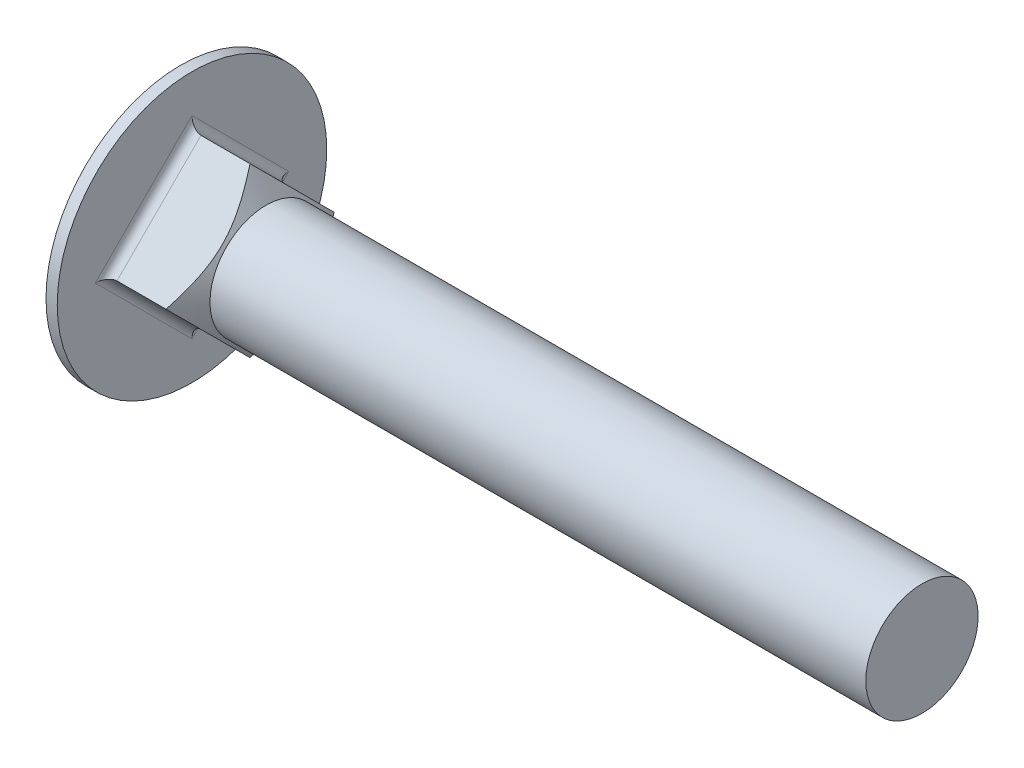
ISO-10303-21;
HEADER;
FILE_DESCRIPTION(('STEP AP214'),'2;1');
FILE_NAME('part.step','',(''),(''),'','','');
FILE_SCHEMA(('AUTOMOTIVE_DESIGN { 1 0 10303 214 1 1 1 1 }'));
ENDSEC;
DATA;
#1=APPLICATION_CONTEXT('core data for automotive mechanical design processes');
#2=APPLICATION_PROTOCOL_DEFINITION('international standard','automotive_design',2000,#1);
#3=PRODUCT_CONTEXT('',#1,'mechanical');
#4=PRODUCT('Part','Part','',(#3));
#5=PRODUCT_RELATED_PRODUCT_CATEGORY('part','',(#4));
#6=PRODUCT_DEFINITION_FORMATION('','',#4);
#7=PRODUCT_DEFINITION_CONTEXT('part definition',#1,'design');
#8=PRODUCT_DEFINITION('design','',#6,#7);
#9=PRODUCT_DEFINITION_SHAPE('','',#8);
#10=(LENGTH_UNIT() NAMED_UNIT(*) SI_UNIT(.MILLI.,.METRE.));
#11=(NAMED_UNIT(*) PLANE_ANGLE_UNIT() SI_UNIT($,.RADIAN.));
#12=(NAMED_UNIT(*) SI_UNIT($,.STERADIAN.) SOLID_ANGLE_UNIT());
#13=UNCERTAINTY_MEASURE_WITH_UNIT(LENGTH_MEASURE(1.E-05),#10,'distance_accuracy_value','');
#14=(GEOMETRIC_REPRESENTATION_CONTEXT(3) GLOBAL_UNCERTAINTY_ASSIGNED_CONTEXT((#13)) GLOBAL_UNIT_ASSIGNED_CONTEXT((#10,
#11,#12)) REPRESENTATION_CONTEXT('',''));
#15=CARTESIAN_POINT('',(0.,0.,0.));
#16=DIRECTION('',(0.,0.,1.));
#17=DIRECTION('',(1.,0.,0.));
#18=AXIS2_PLACEMENT_3D('',#15,#16,#17);
#19=CARTESIAN_POINT('',(11.6,7.48118974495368,0.));
#20=DIRECTION('',(0.,-0.707106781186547,-0.707106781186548));
#21=DIRECTION('',(0.,0.707106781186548,-0.707106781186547));
#22=AXIS2_PLACEMENT_3D('',#19,#20,#21);
#23=PLANE('',#22);
#24=DIRECTION('',(-1.,0.,0.));
#25=VECTOR('',#24,1.);
#26=CARTESIAN_POINT('',(11.6,7.48118974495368,0.));
#27=LINE('',#26,#25);
#28=CARTESIAN_POINT('',(10.1674844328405,7.48118974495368,0.));
#29=VERTEX_POINT('',#28);
#30=CARTESIAN_POINT('',(5.8,7.48118974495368,0.));
#31=VERTEX_POINT('',#30);
#32=EDGE_CURVE('E97',#29,#31,#27,.T.);
#33=ORIENTED_EDGE('',*,*,#32,.T.);
#34=DIRECTION('',(0.,-0.707106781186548,0.707106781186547));
#35=VECTOR('',#34,1.);
#36=CARTESIAN_POINT('',(5.8,0.,7.48118974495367));
#37=LINE('',#36,#35);
#38=CARTESIAN_POINT('',(5.8,0.,7.48118974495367));
#39=VERTEX_POINT('',#38);
#40=EDGE_CURVE('E11',#31,#39,#37,.T.);
#41=ORIENTED_EDGE('',*,*,#40,.T.);
#42=DIRECTION('',(-1.,0.,0.));
#43=VECTOR('',#42,1.);
#44=CARTESIAN_POINT('',(11.6,0.,7.48118974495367));
#45=LINE('',#44,#43);
#46=CARTESIAN_POINT('',(10.1674844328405,0.,7.48118974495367));
#47=VERTEX_POINT('',#46);
#48=EDGE_CURVE('E100',#47,#39,#45,.T.);
#49=ORIENTED_EDGE('',*,*,#48,.F.);
#50=CARTESIAN_POINT('',(10.1673689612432,7.48138974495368,-0.000200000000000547));
#51=CARTESIAN_POINT('',(10.240783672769,7.35418891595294,0.12700082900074));
#52=CARTESIAN_POINT('',(10.3126426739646,7.22652847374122,0.254661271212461));
#53=CARTESIAN_POINT('',(10.4525130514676,6.97010913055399,0.511080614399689));
#54=CARTESIAN_POINT('',(10.5205230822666,6.84134986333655,0.639839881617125));
#55=CARTESIAN_POINT('',(10.6523125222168,6.58184380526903,0.89934593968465));
#56=CARTESIAN_POINT('',(10.7160632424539,6.45108965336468,1.03010009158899));
#57=CARTESIAN_POINT('',(10.8378670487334,6.18828600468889,1.29290374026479));
#58=CARTESIAN_POINT('',(10.8959206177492,6.05623661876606,1.42495312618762));
#59=CARTESIAN_POINT('',(11.0579955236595,5.66240203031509,1.81878771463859));
#60=CARTESIAN_POINT('',(11.1522638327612,5.39848601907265,2.08270372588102));
#61=CARTESIAN_POINT('',(11.2659727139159,4.9989997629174,2.48218998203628));
#62=CARTESIAN_POINT('',(11.2992396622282,4.8653775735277,2.61581217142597));
#63=CARTESIAN_POINT('',(11.3553270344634,4.59703103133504,2.88415871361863));
#64=CARTESIAN_POINT('',(11.3781485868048,4.46230679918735,3.01888294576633));
#65=CARTESIAN_POINT('',(11.4095386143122,4.21418271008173,3.26700703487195));
#66=CARTESIAN_POINT('',(11.419825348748,4.10089096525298,3.3802987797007));
#67=CARTESIAN_POINT('',(11.432020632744,3.87408144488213,3.60710830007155));
#68=CARTESIAN_POINT('',(11.4339294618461,3.76056367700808,3.72062606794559));
#69=CARTESIAN_POINT('',(11.429298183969,3.53356534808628,3.9476243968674));
#70=CARTESIAN_POINT('',(11.4227543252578,3.42008482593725,4.06110491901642));
#71=CARTESIAN_POINT('',(11.4014440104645,3.19351279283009,4.28767695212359));
#72=CARTESIAN_POINT('',(11.3866774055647,3.08042128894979,4.40076845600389));
#73=CARTESIAN_POINT('',(11.3493818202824,2.85469228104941,4.62649746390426));
#74=CARTESIAN_POINT('',(11.3268398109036,2.74205586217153,4.73913388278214));
#75=CARTESIAN_POINT('',(11.2746714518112,2.51760014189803,4.96358960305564));
#76=CARTESIAN_POINT('',(11.2450439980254,2.40578097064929,5.07540877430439));
#77=CARTESIAN_POINT('',(11.1466904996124,2.07172551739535,5.40946422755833));
#78=CARTESIAN_POINT('',(11.0684895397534,1.85087007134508,5.6303196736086));
#79=CARTESIAN_POINT('',(10.9249180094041,1.49278451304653,5.98840523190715));
#80=CARTESIAN_POINT('',(10.8652320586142,1.35436598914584,6.12682375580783));
#81=CARTESIAN_POINT('',(10.7394865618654,1.07902541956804,6.40216432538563));
#82=CARTESIAN_POINT('',(10.6734289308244,0.942102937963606,6.53908680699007));
#83=CARTESIAN_POINT('',(10.536441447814,0.670289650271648,6.81090009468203));
#84=CARTESIAN_POINT('',(10.4655384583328,0.535392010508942,6.94579773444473));
#85=CARTESIAN_POINT('',(10.3194467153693,0.26676122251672,7.21442852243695));
#86=CARTESIAN_POINT('',(10.244258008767,0.133028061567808,7.34816168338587));
#87=CARTESIAN_POINT('',(10.1673689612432,-0.000199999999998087,7.48138974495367));
#88=B_SPLINE_CURVE_WITH_KNOTS('',3,(#50,#51,#52,#53,#54,#55,#56,#57,#58,#59,#60,#61,#62,#63,#64,
#65,#66,#67,#68,#69,#70,#71,#72,#73,#74,#75,#76,#77,#78,#79,#80,#81,#82,#83,#84,#85,#86,#87),
.UNSPECIFIED.,.F.,.F.,(4,2,2,2,2,2,2,2,2,2,2,2,2,2,2,2,2,2,4),(0.,0.582891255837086,
1.16598503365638,1.7526761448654,2.33931747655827,3.49252008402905,4.0679164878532,
4.64325071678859,5.1246910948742,5.60611540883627,6.08775347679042,6.56940026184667,
7.05185807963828,7.53439112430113,8.49936674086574,9.11323203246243,9.72691340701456,
10.3374322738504,10.9479444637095),.UNSPECIFIED.);
#89=EDGE_CURVE('E89',#29,#47,#88,.T.);
#90=ORIENTED_EDGE('',*,*,#89,.F.);
#91=EDGE_LOOP('',(#33,#41,#49,#90));
#92=FACE_BOUND('',#91,.T.);
#93=ADVANCED_FACE('F35',(#92),#23,.F.);
#94=CARTESIAN_POINT('',(11.6,0.,7.48118974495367));
#95=DIRECTION('',(0.,0.707106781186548,-0.707106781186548));
#96=DIRECTION('',(0.,0.707106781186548,0.707106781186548));
#97=AXIS2_PLACEMENT_3D('',#94,#95,#96);
#98=PLANE('',#97);
#99=ORIENTED_EDGE('',*,*,#48,.T.);
#100=DIRECTION('',(0.,-0.707106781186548,-0.707106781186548));
#101=VECTOR('',#100,1.);
#102=CARTESIAN_POINT('',(5.8,-7.48118974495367,0.));
#103=LINE('',#102,#101);
#104=CARTESIAN_POINT('',(5.8,-7.48118974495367,0.));
#105=VERTEX_POINT('',#104);
#106=EDGE_CURVE('E44',#39,#105,#103,.T.);
#107=ORIENTED_EDGE('',*,*,#106,.T.);
#108=DIRECTION('',(-1.,0.,0.));
#109=VECTOR('',#108,1.);
#110=CARTESIAN_POINT('',(11.6,-7.48118974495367,0.));
#111=LINE('',#110,#109);
#112=CARTESIAN_POINT('',(10.1674844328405,-7.48118974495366,0.));
#113=VERTEX_POINT('',#112);
#114=EDGE_CURVE('E101',#113,#105,#111,.T.);
#115=ORIENTED_EDGE('',*,*,#114,.F.);
#116=CARTESIAN_POINT('',(10.1673689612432,0.000200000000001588,7.48138974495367));
#117=CARTESIAN_POINT('',(10.240783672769,-0.12700082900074,7.35418891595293));
#118=CARTESIAN_POINT('',(10.3126426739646,-0.25466127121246,7.22652847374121));
#119=CARTESIAN_POINT('',(10.4525130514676,-0.511080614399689,6.97010913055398));
#120=CARTESIAN_POINT('',(10.5205230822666,-0.639839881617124,6.84134986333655));
#121=CARTESIAN_POINT('',(10.6523125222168,-0.89934593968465,6.58184380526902));
#122=CARTESIAN_POINT('',(10.7160632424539,-1.03010009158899,6.45108965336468));
#123=CARTESIAN_POINT('',(10.8378670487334,-1.29290374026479,6.18828600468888));
#124=CARTESIAN_POINT('',(10.8959206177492,-1.42495312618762,6.05623661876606));
#125=CARTESIAN_POINT('',(11.0579955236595,-1.81878771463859,5.66240203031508));
#126=CARTESIAN_POINT('',(11.1522638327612,-2.08270372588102,5.39848601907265));
#127=CARTESIAN_POINT('',(11.2659727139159,-2.48218998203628,4.99899976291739));
#128=CARTESIAN_POINT('',(11.2992396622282,-2.61581217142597,4.8653775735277));
#129=CARTESIAN_POINT('',(11.3553270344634,-2.88415871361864,4.59703103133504));
#130=CARTESIAN_POINT('',(11.3781485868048,-3.01888294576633,4.46230679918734));
#131=CARTESIAN_POINT('',(11.4095386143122,-3.26700703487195,4.21418271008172));
#132=CARTESIAN_POINT('',(11.419825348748,-3.3802987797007,4.10089096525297));
#133=CARTESIAN_POINT('',(11.432020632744,-3.60710830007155,3.87408144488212));
#134=CARTESIAN_POINT('',(11.4339294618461,-3.7206260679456,3.76056367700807));
#135=CARTESIAN_POINT('',(11.4292981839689,-3.9476243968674,3.53356534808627));
#136=CARTESIAN_POINT('',(11.4227543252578,-4.06110491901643,3.42008482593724));
#137=CARTESIAN_POINT('',(11.4014440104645,-4.28767695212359,3.19351279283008));
#138=CARTESIAN_POINT('',(11.3866774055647,-4.40076845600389,3.08042128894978));
#139=CARTESIAN_POINT('',(11.3493818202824,-4.62649746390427,2.8546922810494));
#140=CARTESIAN_POINT('',(11.3268398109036,-4.73913388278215,2.74205586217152));
#141=CARTESIAN_POINT('',(11.2746714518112,-4.96358960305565,2.51760014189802));
#142=CARTESIAN_POINT('',(11.2450439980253,-5.07540877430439,2.40578097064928));
#143=CARTESIAN_POINT('',(11.1466904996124,-5.40946422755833,2.07172551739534));
#144=CARTESIAN_POINT('',(11.0684895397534,-5.63031967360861,1.85087007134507));
#145=CARTESIAN_POINT('',(10.9249180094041,-5.98840523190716,1.49278451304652));
#146=CARTESIAN_POINT('',(10.8652320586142,-6.12682375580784,1.35436598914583));
#147=CARTESIAN_POINT('',(10.7394865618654,-6.40216432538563,1.07902541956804));
#148=CARTESIAN_POINT('',(10.6734289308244,-6.53908680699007,0.942102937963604));
#149=CARTESIAN_POINT('',(10.536441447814,-6.81090009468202,0.67028965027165));
#150=CARTESIAN_POINT('',(10.4655384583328,-6.94579773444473,0.535392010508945));
#151=CARTESIAN_POINT('',(10.3194467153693,-7.21442852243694,0.266761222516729));
#152=CARTESIAN_POINT('',(10.244258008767,-7.34816168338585,0.133028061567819));
#153=CARTESIAN_POINT('',(10.1673689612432,-7.48138974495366,-0.000199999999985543));
#154=B_SPLINE_CURVE_WITH_KNOTS('',3,(#116,#117,#118,#119,#120,#121,#122,#123,#124,#125,#126,
#127,#128,#129,#130,#131,#132,#133,#134,#135,#136,#137,#138,#139,#140,#141,#142,#143,#144,#145,
#146,#147,#148,#149,#150,#151,#152,#153),.UNSPECIFIED.,.F.,.F.,(4,2,2,2,2,2,2,2,2,2,2,2,2,2,2,2,
2,2,4),(0.,0.582891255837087,1.16598503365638,1.7526761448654,2.33931747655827,3.49252008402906,
4.06791648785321,4.6432507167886,5.1246910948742,5.60611540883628,6.08775347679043,
6.56940026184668,7.05185807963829,7.53439112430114,8.49936674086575,9.11323203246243,
9.72691340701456,10.3374322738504,10.9479444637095),.UNSPECIFIED.);
#155=EDGE_CURVE('E92',#47,#113,#154,.T.);
#156=ORIENTED_EDGE('',*,*,#155,.F.);
#157=EDGE_LOOP('',(#99,#107,#115,#156));
#158=FACE_BOUND('',#157,.T.);
#159=ADVANCED_FACE('F99',(#158),#98,.F.);
#160=CARTESIAN_POINT('',(11.6,-7.48118974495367,0.));
#161=DIRECTION('',(0.,0.707106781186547,0.707106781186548));
#162=DIRECTION('',(0.,-0.707106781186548,0.707106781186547));
#163=AXIS2_PLACEMENT_3D('',#160,#161,#162);
#164=PLANE('',#163);
#165=ORIENTED_EDGE('',*,*,#114,.T.);
#166=DIRECTION('',(0.,0.707106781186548,-0.707106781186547));
#167=VECTOR('',#166,1.);
#168=CARTESIAN_POINT('',(5.8,0.,-7.48118974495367));
#169=LINE('',#168,#167);
#170=CARTESIAN_POINT('',(5.8,0.,-7.48118974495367));
#171=VERTEX_POINT('',#170);
#172=EDGE_CURVE('E127',#105,#171,#169,.T.);
#173=ORIENTED_EDGE('',*,*,#172,.T.);
#174=DIRECTION('',(-1.,0.,0.));
#175=VECTOR('',#174,1.);
#176=CARTESIAN_POINT('',(11.6,0.,-7.48118974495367));
#177=LINE('',#176,#175);
#178=CARTESIAN_POINT('',(10.1674844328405,0.,-7.48118974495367));
#179=VERTEX_POINT('',#178);
#180=EDGE_CURVE('E109',#179,#171,#177,.T.);
#181=ORIENTED_EDGE('',*,*,#180,.F.);
#182=CARTESIAN_POINT('',(10.1673689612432,-7.48138974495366,0.000199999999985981));
#183=CARTESIAN_POINT('',(10.240783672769,-7.35418891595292,-0.127000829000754));
#184=CARTESIAN_POINT('',(10.3126426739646,-7.2265284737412,-0.254661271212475));
#185=CARTESIAN_POINT('',(10.4525130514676,-6.97010913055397,-0.511080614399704));
#186=CARTESIAN_POINT('',(10.5205230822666,-6.84134986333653,-0.63983988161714));
#187=CARTESIAN_POINT('',(10.6523125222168,-6.58184380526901,-0.899345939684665));
#188=CARTESIAN_POINT('',(10.7160632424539,-6.45108965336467,-1.03010009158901));
#189=CARTESIAN_POINT('',(10.8378670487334,-6.18828600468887,-1.2929037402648));
#190=CARTESIAN_POINT('',(10.8959206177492,-6.05623661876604,-1.42495312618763));
#191=CARTESIAN_POINT('',(11.0579955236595,-5.66240203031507,-1.8187877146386));
#192=CARTESIAN_POINT('',(11.1522638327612,-5.39848601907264,-2.08270372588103));
#193=CARTESIAN_POINT('',(11.2659727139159,-4.99899976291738,-2.48218998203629));
#194=CARTESIAN_POINT('',(11.2992396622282,-4.86537757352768,-2.61581217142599));
#195=CARTESIAN_POINT('',(11.3553270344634,-4.59703103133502,-2.88415871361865));
#196=CARTESIAN_POINT('',(11.3781485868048,-4.46230679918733,-3.01888294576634));
#197=CARTESIAN_POINT('',(11.4095386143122,-4.21418271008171,-3.26700703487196));
#198=CARTESIAN_POINT('',(11.419825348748,-4.10089096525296,-3.38029877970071));
#199=CARTESIAN_POINT('',(11.432020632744,-3.87408144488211,-3.60710830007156));
#200=CARTESIAN_POINT('',(11.433929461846,-3.76056367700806,-3.72062606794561));
#201=CARTESIAN_POINT('',(11.4292981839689,-3.53356534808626,-3.94762439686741));
#202=CARTESIAN_POINT('',(11.4227543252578,-3.42008482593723,-4.06110491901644));
#203=CARTESIAN_POINT('',(11.4014440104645,-3.19351279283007,-4.2876769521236));
#204=CARTESIAN_POINT('',(11.3866774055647,-3.08042128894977,-4.4007684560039));
#205=CARTESIAN_POINT('',(11.3493818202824,-2.85469228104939,-4.62649746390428));
#206=CARTESIAN_POINT('',(11.3268398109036,-2.74205586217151,-4.73913388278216));
#207=CARTESIAN_POINT('',(11.2746714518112,-2.51760014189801,-4.96358960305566));
#208=CARTESIAN_POINT('',(11.2450439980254,-2.40578097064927,-5.0754087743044));
#209=CARTESIAN_POINT('',(11.1466904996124,-2.07172551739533,-5.40946422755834));
#210=CARTESIAN_POINT('',(11.0684895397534,-1.85087007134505,-5.63031967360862));
#211=CARTESIAN_POINT('',(10.9249180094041,-1.49278451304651,-5.98840523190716));
#212=CARTESIAN_POINT('',(10.8652320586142,-1.35436598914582,-6.12682375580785));
#213=CARTESIAN_POINT('',(10.7394865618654,-1.07902541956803,-6.40216432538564));
#214=CARTESIAN_POINT('',(10.6734289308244,-0.94210293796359,-6.53908680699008));
#215=CARTESIAN_POINT('',(10.536441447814,-0.670289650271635,-6.81090009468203));
#216=CARTESIAN_POINT('',(10.4655384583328,-0.53539201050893,-6.94579773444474));
#217=CARTESIAN_POINT('',(10.3194467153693,-0.266761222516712,-7.21442852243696));
#218=CARTESIAN_POINT('',(10.244258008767,-0.133028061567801,-7.34816168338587));
#219=CARTESIAN_POINT('',(10.1673689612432,0.000200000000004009,-7.48138974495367));
#220=B_SPLINE_CURVE_WITH_KNOTS('',3,(#182,#183,#184,#185,#186,#187,#188,#189,#190,#191,#192,
#193,#194,#195,#196,#197,#198,#199,#200,#201,#202,#203,#204,#205,#206,#207,#208,#209,#210,#211,
#212,#213,#214,#215,#216,#217,#218,#219),.UNSPECIFIED.,.F.,.F.,(4,2,2,2,2,2,2,2,2,2,2,2,2,2,2,2,
2,2,4),(0.,0.582891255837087,1.16598503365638,1.7526761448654,2.33931747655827,3.49252008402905,
4.0679164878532,4.64325071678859,5.1246910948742,5.60611540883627,6.08775347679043,
6.56940026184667,7.05185807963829,7.53439112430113,8.49936674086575,9.11323203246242,
9.72691340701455,10.3374322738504,10.9479444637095),.UNSPECIFIED.);
#221=EDGE_CURVE('E102',#113,#179,#220,.T.);
#222=ORIENTED_EDGE('',*,*,#221,.F.);
#223=EDGE_LOOP('',(#165,#173,#181,#222));
#224=FACE_BOUND('',#223,.T.);
#225=ADVANCED_FACE('F184',(#224),#164,.F.);
#226=CARTESIAN_POINT('',(11.6,0.,-7.48118974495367));
#227=DIRECTION('',(0.,-0.707106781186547,0.707106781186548));
#228=DIRECTION('',(0.,-0.707106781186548,-0.707106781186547));
#229=AXIS2_PLACEMENT_3D('',#226,#227,#228);
#230=PLANE('',#229);
#231=ORIENTED_EDGE('',*,*,#180,.T.);
#232=DIRECTION('',(0.,0.707106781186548,0.707106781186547));
#233=VECTOR('',#232,1.);
#234=CARTESIAN_POINT('',(5.8,7.48118974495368,0.));
#235=LINE('',#234,#233);
#236=EDGE_CURVE('E115',#171,#31,#235,.T.);
#237=ORIENTED_EDGE('',*,*,#236,.T.);
#238=ORIENTED_EDGE('',*,*,#32,.F.);
#239=CARTESIAN_POINT('',(10.1673689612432,-0.000199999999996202,-7.48138974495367));
#240=CARTESIAN_POINT('',(10.240783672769,0.127000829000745,-7.35418891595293));
#241=CARTESIAN_POINT('',(10.3126426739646,0.254661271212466,-7.22652847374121));
#242=CARTESIAN_POINT('',(10.4525130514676,0.511080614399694,-6.97010913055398));
#243=CARTESIAN_POINT('',(10.5205230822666,0.639839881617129,-6.84134986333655));
#244=CARTESIAN_POINT('',(10.6523125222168,0.899345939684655,-6.58184380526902));
#245=CARTESIAN_POINT('',(10.7160632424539,1.030100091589,-6.45108965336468));
#246=CARTESIAN_POINT('',(10.8378670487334,1.29290374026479,-6.18828600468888));
#247=CARTESIAN_POINT('',(10.8959206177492,1.42495312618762,-6.05623661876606));
#248=CARTESIAN_POINT('',(11.0579955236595,1.81878771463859,-5.66240203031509));
#249=CARTESIAN_POINT('',(11.1522638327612,2.08270372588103,-5.39848601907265));
#250=CARTESIAN_POINT('',(11.2659727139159,2.48218998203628,-4.99899976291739));
#251=CARTESIAN_POINT('',(11.2992396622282,2.61581217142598,-4.8653775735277));
#252=CARTESIAN_POINT('',(11.3553270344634,2.88415871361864,-4.59703103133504));
#253=CARTESIAN_POINT('',(11.3781485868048,3.01888294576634,-4.46230679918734));
#254=CARTESIAN_POINT('',(11.4095386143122,3.26700703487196,-4.21418271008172));
#255=CARTESIAN_POINT('',(11.419825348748,3.3802987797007,-4.10089096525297));
#256=CARTESIAN_POINT('',(11.432020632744,3.60710830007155,-3.87408144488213));
#257=CARTESIAN_POINT('',(11.4339294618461,3.7206260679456,-3.76056367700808));
#258=CARTESIAN_POINT('',(11.4292981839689,3.9476243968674,-3.53356534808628));
#259=CARTESIAN_POINT('',(11.4227543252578,4.06110491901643,-3.42008482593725));
#260=CARTESIAN_POINT('',(11.4014440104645,4.28767695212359,-3.19351279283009));
#261=CARTESIAN_POINT('',(11.3866774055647,4.40076845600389,-3.08042128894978));
#262=CARTESIAN_POINT('',(11.3493818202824,4.62649746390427,-2.85469228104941));
#263=CARTESIAN_POINT('',(11.3268398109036,4.73913388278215,-2.74205586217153));
#264=CARTESIAN_POINT('',(11.2746714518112,4.96358960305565,-2.51760014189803));
#265=CARTESIAN_POINT('',(11.2450439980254,5.07540877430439,-2.40578097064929));
#266=CARTESIAN_POINT('',(11.1466904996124,5.40946422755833,-2.07172551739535));
#267=CARTESIAN_POINT('',(11.0684895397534,5.6303196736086,-1.85087007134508));
#268=CARTESIAN_POINT('',(10.9249180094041,5.98840523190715,-1.49278451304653));
#269=CARTESIAN_POINT('',(10.8652320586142,6.12682375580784,-1.35436598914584));
#270=CARTESIAN_POINT('',(10.7394865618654,6.40216432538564,-1.07902541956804));
#271=CARTESIAN_POINT('',(10.6734289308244,6.53908680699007,-0.942102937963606));
#272=CARTESIAN_POINT('',(10.5364414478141,6.81090009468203,-0.670289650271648));
#273=CARTESIAN_POINT('',(10.4655384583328,6.94579773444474,-0.535392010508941));
#274=CARTESIAN_POINT('',(10.3194467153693,7.21442852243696,-0.26676122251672));
#275=CARTESIAN_POINT('',(10.244258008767,7.34816168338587,-0.133028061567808));
#276=CARTESIAN_POINT('',(10.1673689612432,7.48138974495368,0.000199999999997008));
#277=B_SPLINE_CURVE_WITH_KNOTS('',3,(#239,#240,#241,#242,#243,#244,#245,#246,#247,#248,#249,
#250,#251,#252,#253,#254,#255,#256,#257,#258,#259,#260,#261,#262,#263,#264,#265,#266,#267,#268,
#269,#270,#271,#272,#273,#274,#275,#276),.UNSPECIFIED.,.F.,.F.,(4,2,2,2,2,2,2,2,2,2,2,2,2,2,2,2,
2,2,4),(0.,0.582891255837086,1.16598503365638,1.7526761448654,2.33931747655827,3.49252008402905,
4.0679164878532,4.64325071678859,5.1246910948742,5.60611540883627,6.08775347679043,
6.56940026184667,7.05185807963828,7.53439112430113,8.49936674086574,9.11323203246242,
9.72691340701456,10.3374322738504,10.9479444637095),.UNSPECIFIED.);
#278=EDGE_CURVE('E95',#179,#29,#277,.T.);
#279=ORIENTED_EDGE('',*,*,#278,.F.);
#280=EDGE_LOOP('',(#231,#237,#238,#279));
#281=FACE_BOUND('',#280,.T.);
#282=ADVANCED_FACE('F159',(#281),#230,.F.);
#283=CARTESIAN_POINT('',(5.,12.,0.));
#284=DIRECTION('',(-1.,0.,0.));
#285=DIRECTION('',(0.,0.,1.));
#286=AXIS2_PLACEMENT_3D('',#283,#284,#285);
#287=PLANE('',#286);
#288=DIRECTION('',(0.,-0.707106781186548,0.707106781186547));
#289=VECTOR('',#288,1.);
#290=CARTESIAN_POINT('',(5.,8.04687516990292,0.565685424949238));
#291=LINE('',#290,#289);
#292=CARTESIAN_POINT('',(5.,0.,8.61256059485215));
#293=VERTEX_POINT('',#292);
#294=CARTESIAN_POINT('',(5.,8.61256059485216,0.));
#295=VERTEX_POINT('',#294);
#296=EDGE_CURVE('E118',#293,#295,#291,.F.);
#297=ORIENTED_EDGE('',*,*,#296,.T.);
#298=DIRECTION('',(0.,0.707106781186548,0.707106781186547));
#299=VECTOR('',#298,1.);
#300=CARTESIAN_POINT('',(5.,0.565685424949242,-8.04687516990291));
#301=LINE('',#300,#299);
#302=CARTESIAN_POINT('',(5.,0.,-8.61256059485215));
#303=VERTEX_POINT('',#302);
#304=EDGE_CURVE('E124',#295,#303,#301,.F.);
#305=ORIENTED_EDGE('',*,*,#304,.T.);
#306=DIRECTION('',(0.,0.707106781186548,-0.707106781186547));
#307=VECTOR('',#306,1.);
#308=CARTESIAN_POINT('',(5.,-8.04687516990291,-0.565685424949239));
#309=LINE('',#308,#307);
#310=CARTESIAN_POINT('',(5.,-8.61256059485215,0.));
#311=VERTEX_POINT('',#310);
#312=EDGE_CURVE('E122',#303,#311,#309,.F.);
#313=ORIENTED_EDGE('',*,*,#312,.T.);
#314=DIRECTION('',(0.,-0.707106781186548,-0.707106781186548));
#315=VECTOR('',#314,1.);
#316=CARTESIAN_POINT('',(5.,-0.565685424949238,8.04687516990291));
#317=LINE('',#316,#315);
#318=EDGE_CURVE('E120',#311,#293,#317,.F.);
#319=ORIENTED_EDGE('',*,*,#318,.T.);
#320=EDGE_LOOP('',(#297,#305,#313,#319));
#321=FACE_BOUND('',#320,.T.);
#322=CARTESIAN_POINT('',(5.,0.,0.));
#323=DIRECTION('',(-1.,0.,0.));
#324=DIRECTION('',(0.,0.,1.));
#325=AXIS2_PLACEMENT_3D('',#322,#323,#324);
#326=CIRCLE('',#325,12.);
#327=CARTESIAN_POINT('',(5.,0.,12.));
#328=VERTEX_POINT('',#327);
#329=EDGE_CURVE('E107',#328,#328,#326,.T.);
#330=ORIENTED_EDGE('',*,*,#329,.F.);
#331=EDGE_LOOP('',(#330));
#332=FACE_BOUND('',#331,.T.);
#333=ADVANCED_FACE('F193',(#321,#332),#287,.F.);
#334=CARTESIAN_POINT('',(20.,0.,0.));
#335=DIRECTION('',(-1.,0.,0.));
#336=DIRECTION('',(0.,1.,0.));
#337=AXIS2_PLACEMENT_3D('',#334,#335,#336);
#338=SPHERICAL_SURFACE('',#337,20.);
#339=CARTESIAN_POINT('',(4.,0.,0.));
#340=DIRECTION('',(-1.,0.,0.));
#341=DIRECTION('',(0.,0.,1.));
#342=AXIS2_PLACEMENT_3D('',#339,#340,#341);
#343=CIRCLE('',#342,12.);
#344=CARTESIAN_POINT('',(4.,0.,12.));
#345=VERTEX_POINT('',#344);
#346=EDGE_CURVE('E104',#345,#345,#343,.T.);
#347=ORIENTED_EDGE('',*,*,#346,.T.);
#348=EDGE_LOOP('',(#347));
#349=FACE_BOUND('',#348,.T.);
#350=ADVANCED_FACE('F191',(#349),#338,.T.);
#351=CARTESIAN_POINT('',(-9.82817590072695,0.,0.));
#352=DIRECTION('',(-1.,0.,0.));
#353=DIRECTION('',(0.,0.,1.));
#354=AXIS2_PLACEMENT_3D('',#351,#352,#353);
#355=CYLINDRICAL_SURFACE('',#354,12.);
#356=ORIENTED_EDGE('',*,*,#346,.F.);
#357=EDGE_LOOP('',(#356));
#358=FACE_BOUND('',#357,.T.);
#359=ORIENTED_EDGE('',*,*,#329,.T.);
#360=EDGE_LOOP('',(#359));
#361=FACE_BOUND('',#360,.T.);
#362=ADVANCED_FACE('F164',(#358,#361),#355,.T.);
#363=CARTESIAN_POINT('',(10.1674844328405,0.,0.));
#364=DIRECTION('',(-1.,0.,0.));
#365=DIRECTION('',(0.,0.,1.));
#366=AXIS2_PLACEMENT_3D('',#363,#364,#365);
#367=CONICAL_SURFACE('',#366,7.48118974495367,1.0471975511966);
#368=CARTESIAN_POINT('',(11.6,0.,0.));
#369=DIRECTION('',(-1.,0.,0.));
#370=DIRECTION('',(0.,0.,1.));
#371=AXIS2_PLACEMENT_3D('',#368,#369,#370);
#372=CIRCLE('',#371,4.99999999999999);
#373=CARTESIAN_POINT('',(11.6,0.,4.99999999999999));
#374=VERTEX_POINT('',#373);
#375=EDGE_CURVE('E133',#374,#374,#372,.T.);
#376=ORIENTED_EDGE('',*,*,#375,.T.);
#377=EDGE_LOOP('',(#376));
#378=FACE_BOUND('',#377,.T.);
#379=ORIENTED_EDGE('',*,*,#89,.T.);
#380=ORIENTED_EDGE('',*,*,#155,.T.);
#381=ORIENTED_EDGE('',*,*,#221,.T.);
#382=ORIENTED_EDGE('',*,*,#278,.T.);
#383=EDGE_LOOP('',(#379,#380,#381,#382));
#384=FACE_BOUND('',#383,.T.);
#385=ADVANCED_FACE('F91',(#378,#384),#367,.T.);
#386=CARTESIAN_POINT('',(5.8,-0.565685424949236,8.04687516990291));
#387=DIRECTION('',(0.,0.707106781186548,0.707106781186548));
#388=DIRECTION('',(0.,-0.707106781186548,0.707106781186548));
#389=AXIS2_PLACEMENT_3D('',#386,#387,#388);
#390=CYLINDRICAL_SURFACE('',#389,0.8);
#391=CARTESIAN_POINT('',(5.8,0.,8.61256059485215));
#392=DIRECTION('',(0.,1.,0.));
#393=DIRECTION('',(0.,0.,-1.));
#394=AXIS2_PLACEMENT_3D('',#391,#392,#393);
#395=ELLIPSE('',#394,1.13137084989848,0.8);
#396=EDGE_CURVE('E134',#293,#39,#395,.F.);
#397=ORIENTED_EDGE('',*,*,#396,.F.);
#398=ORIENTED_EDGE('',*,*,#318,.F.);
#399=CARTESIAN_POINT('',(5.8,-8.61256059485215,0.));
#400=DIRECTION('',(0.,0.,1.));
#401=DIRECTION('',(0.,1.,0.));
#402=AXIS2_PLACEMENT_3D('',#399,#400,#401);
#403=ELLIPSE('',#402,1.13137084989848,0.8);
#404=EDGE_CURVE('E39',#105,#311,#403,.T.);
#405=ORIENTED_EDGE('',*,*,#404,.F.);
#406=ORIENTED_EDGE('',*,*,#106,.F.);
#407=EDGE_LOOP('',(#397,#398,#405,#406));
#408=FACE_BOUND('',#407,.T.);
#409=ADVANCED_FACE('F37',(#408),#390,.F.);
#410=CARTESIAN_POINT('',(5.8,-8.04687516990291,-0.565685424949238));
#411=DIRECTION('',(0.,-0.707106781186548,0.707106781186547));
#412=DIRECTION('',(0.,-0.707106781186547,-0.707106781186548));
#413=AXIS2_PLACEMENT_3D('',#410,#411,#412);
#414=CYLINDRICAL_SURFACE('',#413,0.8);
#415=ORIENTED_EDGE('',*,*,#404,.T.);
#416=ORIENTED_EDGE('',*,*,#312,.F.);
#417=CARTESIAN_POINT('',(5.8,0.,-8.61256059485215));
#418=DIRECTION('',(0.,-1.,0.));
#419=DIRECTION('',(0.,0.,1.));
#420=AXIS2_PLACEMENT_3D('',#417,#418,#419);
#421=ELLIPSE('',#420,1.13137084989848,0.8);
#422=EDGE_CURVE('E132',#171,#303,#421,.T.);
#423=ORIENTED_EDGE('',*,*,#422,.F.);
#424=ORIENTED_EDGE('',*,*,#172,.F.);
#425=EDGE_LOOP('',(#415,#416,#423,#424));
#426=FACE_BOUND('',#425,.T.);
#427=ADVANCED_FACE('F206',(#426),#414,.F.);
#428=CARTESIAN_POINT('',(5.8,8.04687516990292,0.565685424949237));
#429=DIRECTION('',(0.,0.707106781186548,-0.707106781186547));
#430=DIRECTION('',(0.,0.707106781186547,0.707106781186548));
#431=AXIS2_PLACEMENT_3D('',#428,#429,#430);
#432=CYLINDRICAL_SURFACE('',#431,0.8);
#433=ORIENTED_EDGE('',*,*,#396,.T.);
#434=ORIENTED_EDGE('',*,*,#40,.F.);
#435=CARTESIAN_POINT('',(5.8,8.61256059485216,0.));
#436=DIRECTION('',(0.,0.,-1.));
#437=DIRECTION('',(0.,1.,0.));
#438=AXIS2_PLACEMENT_3D('',#435,#436,#437);
#439=ELLIPSE('',#438,1.13137084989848,0.8);
#440=EDGE_CURVE('E130',#295,#31,#439,.F.);
#441=ORIENTED_EDGE('',*,*,#440,.F.);
#442=ORIENTED_EDGE('',*,*,#296,.F.);
#443=EDGE_LOOP('',(#433,#434,#441,#442));
#444=FACE_BOUND('',#443,.T.);
#445=ADVANCED_FACE('F203',(#444),#432,.F.);
#446=CARTESIAN_POINT('',(5.8,0.565685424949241,-8.04687516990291));
#447=DIRECTION('',(0.,-0.707106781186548,-0.707106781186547));
#448=DIRECTION('',(0.,0.707106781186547,-0.707106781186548));
#449=AXIS2_PLACEMENT_3D('',#446,#447,#448);
#450=CYLINDRICAL_SURFACE('',#449,0.8);
#451=ORIENTED_EDGE('',*,*,#422,.T.);
#452=ORIENTED_EDGE('',*,*,#304,.F.);
#453=ORIENTED_EDGE('',*,*,#440,.T.);
#454=ORIENTED_EDGE('',*,*,#236,.F.);
#455=EDGE_LOOP('',(#451,#452,#453,#454));
#456=FACE_BOUND('',#455,.T.);
#457=ADVANCED_FACE('F200',(#456),#450,.F.);
#458=CARTESIAN_POINT('',(70.,0.,-5.));
#459=DIRECTION('',(-1.,0.,0.));
#460=DIRECTION('',(0.,0.,1.));
#461=AXIS2_PLACEMENT_3D('',#458,#459,#460);
#462=PLANE('',#461);
#463=CARTESIAN_POINT('',(70.,0.,0.));
#464=DIRECTION('',(-1.,0.,0.));
#465=DIRECTION('',(0.,0.,1.));
#466=AXIS2_PLACEMENT_3D('',#463,#464,#465);
#467=CIRCLE('',#466,5.);
#468=CARTESIAN_POINT('',(70.,0.,5.));
#469=VERTEX_POINT('',#468);
#470=EDGE_CURVE('E315',#469,#469,#467,.T.);
#471=ORIENTED_EDGE('',*,*,#470,.F.);
#472=EDGE_LOOP('',(#471));
#473=FACE_BOUND('',#472,.T.);
#474=ADVANCED_FACE('F166',(#473),#462,.F.);
#475=CARTESIAN_POINT('',(-12.2854470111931,0.,0.));
#476=DIRECTION('',(-1.,0.,0.));
#477=DIRECTION('',(0.,0.,1.));
#478=AXIS2_PLACEMENT_3D('',#475,#476,#477);
#479=CYLINDRICAL_SURFACE('',#478,5.);
#480=ORIENTED_EDGE('',*,*,#375,.F.);
#481=EDGE_LOOP('',(#480));
#482=FACE_BOUND('',#481,.T.);
#483=ORIENTED_EDGE('',*,*,#470,.T.);
#484=EDGE_LOOP('',(#483));
#485=FACE_BOUND('',#484,.T.);
#486=ADVANCED_FACE('F293',(#482,#485),#479,.T.);
#487=CLOSED_SHELL('',(#93,#159,#225,#282,#333,#350,#362,#385,#409,#427,#445,#457,#474,#486));
#488=MANIFOLD_SOLID_BREP('B2',#487);
#489=ADVANCED_BREP_SHAPE_REPRESENTATION('',(#18,#488),#14);
#490=SHAPE_DEFINITION_REPRESENTATION(#9,#489);
ENDSEC;
END-ISO-10303-21;
